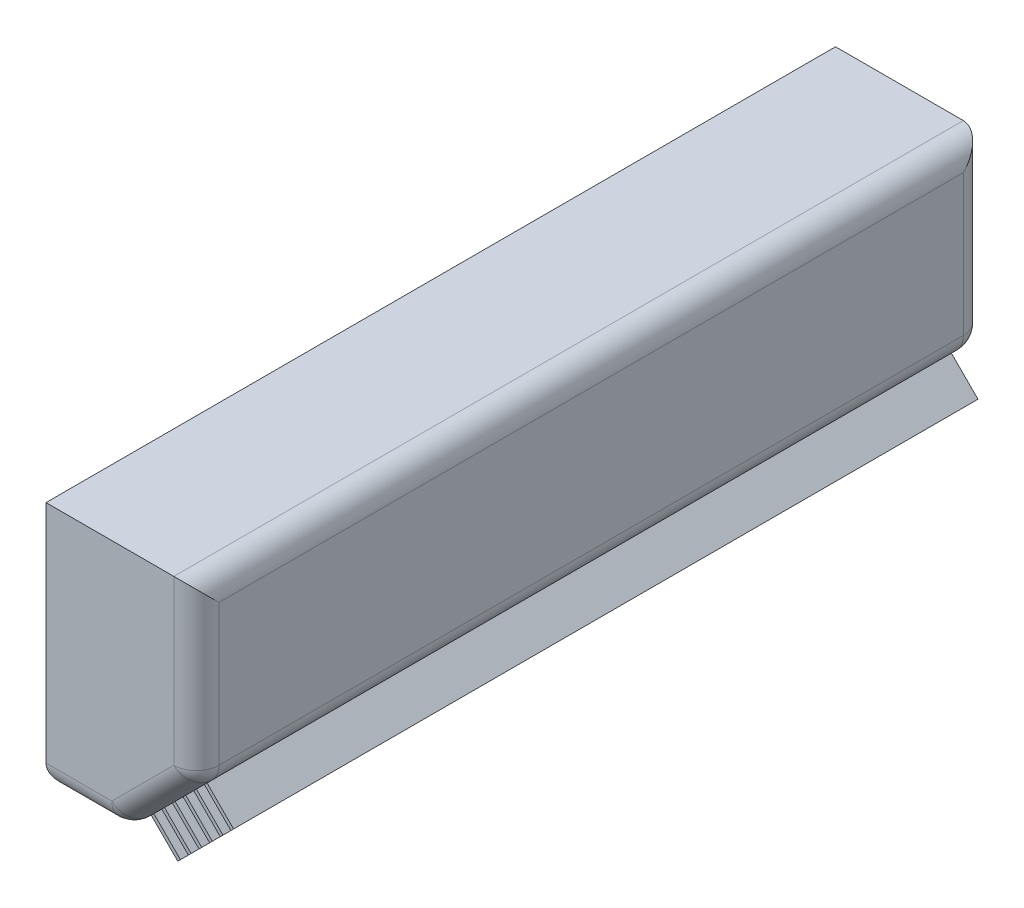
ISO-10303-21;
HEADER;
FILE_DESCRIPTION(('STEP AP214'),'2;1');
FILE_NAME('part.step','',(''),(''),'','','');
FILE_SCHEMA(('AUTOMOTIVE_DESIGN { 1 0 10303 214 1 1 1 1 }'));
ENDSEC;
DATA;
#1=APPLICATION_CONTEXT('core data for automotive mechanical design processes');
#2=APPLICATION_PROTOCOL_DEFINITION('international standard','automotive_design',2000,#1);
#3=PRODUCT_CONTEXT('',#1,'mechanical');
#4=PRODUCT('Part','Part','',(#3));
#5=PRODUCT_RELATED_PRODUCT_CATEGORY('part','',(#4));
#6=PRODUCT_DEFINITION_FORMATION('','',#4);
#7=PRODUCT_DEFINITION_CONTEXT('part definition',#1,'design');
#8=PRODUCT_DEFINITION('design','',#6,#7);
#9=PRODUCT_DEFINITION_SHAPE('','',#8);
#10=(LENGTH_UNIT() NAMED_UNIT(*) SI_UNIT(.MILLI.,.METRE.));
#11=(NAMED_UNIT(*) PLANE_ANGLE_UNIT() SI_UNIT($,.RADIAN.));
#12=(NAMED_UNIT(*) SI_UNIT($,.STERADIAN.) SOLID_ANGLE_UNIT());
#13=UNCERTAINTY_MEASURE_WITH_UNIT(LENGTH_MEASURE(1.E-05),#10,'distance_accuracy_value','');
#14=(GEOMETRIC_REPRESENTATION_CONTEXT(3) GLOBAL_UNCERTAINTY_ASSIGNED_CONTEXT((#13)) GLOBAL_UNIT_ASSIGNED_CONTEXT((#10,
#11,#12)) REPRESENTATION_CONTEXT('',''));
#15=CARTESIAN_POINT('',(0.,0.,0.));
#16=DIRECTION('',(0.,0.,1.));
#17=DIRECTION('',(1.,0.,0.));
#18=AXIS2_PLACEMENT_3D('',#15,#16,#17);
#19=CARTESIAN_POINT('',(0.,-115.,1050.));
#20=DIRECTION('',(-0.707106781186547,0.707106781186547,0.));
#21=DIRECTION('',(-0.707106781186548,-0.707106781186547,0.));
#22=AXIS2_PLACEMENT_3D('',#19,#20,#21);
#23=PLANE('',#22);
#24=DIRECTION('',(0.,0.,1.));
#25=VECTOR('',#24,1.);
#26=CARTESIAN_POINT('',(-86.5685424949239,-201.568542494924,1020.));
#27=LINE('',#26,#25);
#28=CARTESIAN_POINT('',(-86.5685424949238,-201.568542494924,29.9999999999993));
#29=VERTEX_POINT('',#28);
#30=CARTESIAN_POINT('',(-86.5685424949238,-201.568542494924,1020.));
#31=VERTEX_POINT('',#30);
#32=EDGE_CURVE('E593',#29,#31,#27,.T.);
#33=ORIENTED_EDGE('',*,*,#32,.F.);
#34=DIRECTION('',(0.707106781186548,0.707106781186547,0.));
#35=VECTOR('',#34,1.);
#36=CARTESIAN_POINT('',(0.,-115.,30.));
#37=LINE('',#36,#35);
#38=CARTESIAN_POINT('',(-75.9619407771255,-190.961940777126,30.));
#39=VERTEX_POINT('',#38);
#40=EDGE_CURVE('E578',#29,#39,#37,.T.);
#41=ORIENTED_EDGE('',*,*,#40,.T.);
#42=DIRECTION('',(0.,0.,-1.));
#43=VECTOR('',#42,1.);
#44=CARTESIAN_POINT('',(-75.9619407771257,-190.961940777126,1020.));
#45=LINE('',#44,#43);
#46=CARTESIAN_POINT('',(-75.9619407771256,-190.961940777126,1020.));
#47=VERTEX_POINT('',#46);
#48=EDGE_CURVE('E631',#47,#39,#45,.T.);
#49=ORIENTED_EDGE('',*,*,#48,.F.);
#50=DIRECTION('',(0.707106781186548,0.707106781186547,0.));
#51=VECTOR('',#50,1.);
#52=CARTESIAN_POINT('',(-100.,-215.,1020.));
#53=LINE('',#52,#51);
#54=EDGE_CURVE('E594',#47,#31,#53,.F.);
#55=ORIENTED_EDGE('',*,*,#54,.T.);
#56=EDGE_LOOP('',(#33,#41,#49,#55));
#57=FACE_BOUND('',#56,.T.);
#58=ADVANCED_FACE('F350',(#57),#23,.F.);
#59=DIRECTION('',(0.,0.,-1.));
#60=VECTOR('',#59,1.);
#61=CARTESIAN_POINT('',(-90.1040764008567,-205.104076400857,1020.));
#62=LINE('',#61,#60);
#63=CARTESIAN_POINT('',(-90.1040764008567,-205.104076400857,1020.));
#64=VERTEX_POINT('',#63);
#65=CARTESIAN_POINT('',(-90.1040764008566,-205.104076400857,30.));
#66=VERTEX_POINT('',#65);
#67=EDGE_CURVE('E365',#64,#66,#62,.T.);
#68=ORIENTED_EDGE('',*,*,#67,.F.);
#69=CARTESIAN_POINT('',(-91.2132034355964,-206.213203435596,1020.));
#70=VERTEX_POINT('',#69);
#71=EDGE_CURVE('E880',#64,#70,#53,.F.);
#72=ORIENTED_EDGE('',*,*,#71,.T.);
#73=DIRECTION('',(0.,0.,-1.));
#74=VECTOR('',#73,1.);
#75=CARTESIAN_POINT('',(-91.2132034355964,-206.213203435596,1050.));
#76=LINE('',#75,#74);
#77=CARTESIAN_POINT('',(-91.2132034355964,-206.213203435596,30.));
#78=VERTEX_POINT('',#77);
#79=EDGE_CURVE('E11',#70,#78,#76,.T.);
#80=ORIENTED_EDGE('',*,*,#79,.T.);
#81=EDGE_CURVE('E589',#78,#66,#37,.T.);
#82=ORIENTED_EDGE('',*,*,#81,.T.);
#83=EDGE_LOOP('',(#68,#72,#80,#82));
#84=FACE_BOUND('',#83,.T.);
#85=ADVANCED_FACE('F970',(#84),#23,.F.);
#86=DIRECTION('',(0.,0.,1.));
#87=VECTOR('',#86,1.);
#88=CARTESIAN_POINT('',(-72.426406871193,-187.426406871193,1020.));
#89=LINE('',#88,#87);
#90=CARTESIAN_POINT('',(-72.4264068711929,-187.426406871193,29.9999999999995));
#91=VERTEX_POINT('',#90);
#92=CARTESIAN_POINT('',(-72.426406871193,-187.426406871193,1020.));
#93=VERTEX_POINT('',#92);
#94=EDGE_CURVE('E625',#91,#93,#89,.T.);
#95=ORIENTED_EDGE('',*,*,#94,.F.);
#96=CARTESIAN_POINT('',(-61.8198051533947,-176.819805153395,30.));
#97=VERTEX_POINT('',#96);
#98=EDGE_CURVE('E590',#91,#97,#37,.T.);
#99=ORIENTED_EDGE('',*,*,#98,.T.);
#100=DIRECTION('',(0.,0.,-1.));
#101=VECTOR('',#100,1.);
#102=CARTESIAN_POINT('',(-61.8198051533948,-176.819805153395,1020.));
#103=LINE('',#102,#101);
#104=CARTESIAN_POINT('',(-61.8198051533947,-176.819805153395,1020.));
#105=VERTEX_POINT('',#104);
#106=EDGE_CURVE('E661',#105,#97,#103,.T.);
#107=ORIENTED_EDGE('',*,*,#106,.F.);
#108=EDGE_CURVE('E889',#105,#93,#53,.F.);
#109=ORIENTED_EDGE('',*,*,#108,.T.);
#110=EDGE_LOOP('',(#95,#99,#107,#109));
#111=FACE_BOUND('',#110,.T.);
#112=ADVANCED_FACE('F943',(#111),#23,.F.);
#113=DIRECTION('',(0.,0.,1.));
#114=VECTOR('',#113,1.);
#115=CARTESIAN_POINT('',(-58.284271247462,-173.284271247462,1020.));
#116=LINE('',#115,#114);
#117=CARTESIAN_POINT('',(-58.2842712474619,-173.284271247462,29.9999999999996));
#118=VERTEX_POINT('',#117);
#119=CARTESIAN_POINT('',(-58.284271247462,-173.284271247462,1020.));
#120=VERTEX_POINT('',#119);
#121=EDGE_CURVE('E655',#118,#120,#116,.T.);
#122=ORIENTED_EDGE('',*,*,#121,.F.);
#123=CARTESIAN_POINT('',(-47.6776695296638,-162.677669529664,30.));
#124=VERTEX_POINT('',#123);
#125=EDGE_CURVE('E918',#118,#124,#37,.T.);
#126=ORIENTED_EDGE('',*,*,#125,.T.);
#127=DIRECTION('',(0.,0.,-1.));
#128=VECTOR('',#127,1.);
#129=CARTESIAN_POINT('',(-47.6776695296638,-162.677669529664,1020.));
#130=LINE('',#129,#128);
#131=CARTESIAN_POINT('',(-47.6776695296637,-162.677669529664,1020.));
#132=VERTEX_POINT('',#131);
#133=EDGE_CURVE('E694',#132,#124,#130,.T.);
#134=ORIENTED_EDGE('',*,*,#133,.F.);
#135=EDGE_CURVE('E891',#132,#120,#53,.F.);
#136=ORIENTED_EDGE('',*,*,#135,.T.);
#137=EDGE_LOOP('',(#122,#126,#134,#136));
#138=FACE_BOUND('',#137,.T.);
#139=ADVANCED_FACE('F924',(#138),#23,.F.);
#140=DIRECTION('',(0.,0.,1.));
#141=VECTOR('',#140,1.);
#142=CARTESIAN_POINT('',(-44.1421356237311,-159.142135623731,1020.));
#143=LINE('',#142,#141);
#144=CARTESIAN_POINT('',(-44.142135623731,-159.142135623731,29.9999999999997));
#145=VERTEX_POINT('',#144);
#146=CARTESIAN_POINT('',(-44.1421356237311,-159.142135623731,1020.));
#147=VERTEX_POINT('',#146);
#148=EDGE_CURVE('E688',#145,#147,#143,.T.);
#149=ORIENTED_EDGE('',*,*,#148,.F.);
#150=CARTESIAN_POINT('',(-33.5355339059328,-148.535533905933,30.));
#151=VERTEX_POINT('',#150);
#152=EDGE_CURVE('E920',#145,#151,#37,.T.);
#153=ORIENTED_EDGE('',*,*,#152,.T.);
#154=DIRECTION('',(0.,0.,-1.));
#155=VECTOR('',#154,1.);
#156=CARTESIAN_POINT('',(-33.5355339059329,-148.535533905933,1020.));
#157=LINE('',#156,#155);
#158=CARTESIAN_POINT('',(-33.5355339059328,-148.535533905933,1020.));
#159=VERTEX_POINT('',#158);
#160=EDGE_CURVE('E727',#159,#151,#157,.T.);
#161=ORIENTED_EDGE('',*,*,#160,.F.);
#162=EDGE_CURVE('E887',#159,#147,#53,.F.);
#163=ORIENTED_EDGE('',*,*,#162,.T.);
#164=EDGE_LOOP('',(#149,#153,#161,#163));
#165=FACE_BOUND('',#164,.T.);
#166=ADVANCED_FACE('F903',(#165),#23,.F.);
#167=DIRECTION('',(0.,0.,1.));
#168=VECTOR('',#167,1.);
#169=CARTESIAN_POINT('',(-30.0000000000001,-145.,1020.));
#170=LINE('',#169,#168);
#171=CARTESIAN_POINT('',(-30.,-145.,29.9999999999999));
#172=VERTEX_POINT('',#171);
#173=CARTESIAN_POINT('',(-30.0000000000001,-145.,1020.));
#174=VERTEX_POINT('',#173);
#175=EDGE_CURVE('E721',#172,#174,#170,.T.);
#176=ORIENTED_EDGE('',*,*,#175,.F.);
#177=CARTESIAN_POINT('',(-19.3933982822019,-134.393398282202,30.));
#178=VERTEX_POINT('',#177);
#179=EDGE_CURVE('E1007',#172,#178,#37,.T.);
#180=ORIENTED_EDGE('',*,*,#179,.T.);
#181=DIRECTION('',(0.,0.,-1.));
#182=VECTOR('',#181,1.);
#183=CARTESIAN_POINT('',(-19.3933982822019,-134.393398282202,1020.));
#184=LINE('',#183,#182);
#185=CARTESIAN_POINT('',(-19.3933982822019,-134.393398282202,1020.));
#186=VERTEX_POINT('',#185);
#187=EDGE_CURVE('E760',#186,#178,#184,.T.);
#188=ORIENTED_EDGE('',*,*,#187,.F.);
#189=EDGE_CURVE('E882',#186,#174,#53,.F.);
#190=ORIENTED_EDGE('',*,*,#189,.T.);
#191=EDGE_LOOP('',(#176,#180,#188,#190));
#192=FACE_BOUND('',#191,.T.);
#193=ADVANCED_FACE('F979',(#192),#23,.F.);
#194=DIRECTION('',(0.,0.,1.));
#195=VECTOR('',#194,1.);
#196=CARTESIAN_POINT('',(-15.8578643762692,-130.857864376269,1020.));
#197=LINE('',#196,#195);
#198=CARTESIAN_POINT('',(-15.8578643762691,-130.857864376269,30.));
#199=VERTEX_POINT('',#198);
#200=CARTESIAN_POINT('',(-15.8578643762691,-130.857864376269,1020.));
#201=VERTEX_POINT('',#200);
#202=EDGE_CURVE('E754',#199,#201,#197,.T.);
#203=ORIENTED_EDGE('',*,*,#202,.F.);
#204=CARTESIAN_POINT('',(-8.7867965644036,-123.786796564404,30.));
#205=VERTEX_POINT('',#204);
#206=EDGE_CURVE('E877',#199,#205,#37,.T.);
#207=ORIENTED_EDGE('',*,*,#206,.T.);
#208=DIRECTION('',(0.,0.,-1.));
#209=VECTOR('',#208,1.);
#210=CARTESIAN_POINT('',(-8.7867965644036,-123.786796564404,1050.));
#211=LINE('',#210,#209);
#212=CARTESIAN_POINT('',(-8.7867965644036,-123.786796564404,1020.));
#213=VERTEX_POINT('',#212);
#214=EDGE_CURVE('E879',#205,#213,#211,.F.);
#215=ORIENTED_EDGE('',*,*,#214,.T.);
#216=EDGE_CURVE('E358',#213,#201,#53,.F.);
#217=ORIENTED_EDGE('',*,*,#216,.T.);
#218=EDGE_LOOP('',(#203,#207,#215,#217));
#219=FACE_BOUND('',#218,.T.);
#220=ADVANCED_FACE('F972',(#219),#23,.F.);
#221=CARTESIAN_POINT('',(-200.,115.,1050.));
#222=DIRECTION('',(1.,0.,0.));
#223=DIRECTION('',(0.,1.,0.));
#224=AXIS2_PLACEMENT_3D('',#221,#222,#223);
#225=PLANE('',#224);
#226=DIRECTION('',(0.,-1.,0.));
#227=VECTOR('',#226,1.);
#228=CARTESIAN_POINT('',(-200.,115.,0.));
#229=LINE('',#228,#227);
#230=CARTESIAN_POINT('',(-200.,115.,0.));
#231=VERTEX_POINT('',#230);
#232=CARTESIAN_POINT('',(-200.,-185.,0.));
#233=VERTEX_POINT('',#232);
#234=EDGE_CURVE('E830',#231,#233,#229,.T.);
#235=ORIENTED_EDGE('',*,*,#234,.T.);
#236=DIRECTION('',(0.,0.,-1.));
#237=VECTOR('',#236,1.);
#238=CARTESIAN_POINT('',(-200.,-185.,1050.));
#239=LINE('',#238,#237);
#240=CARTESIAN_POINT('',(-200.,-185.,1050.));
#241=VERTEX_POINT('',#240);
#242=EDGE_CURVE('E852',#233,#241,#239,.F.);
#243=ORIENTED_EDGE('',*,*,#242,.T.);
#244=DIRECTION('',(0.,-1.,0.));
#245=VECTOR('',#244,1.);
#246=CARTESIAN_POINT('',(-200.,115.,1050.));
#247=LINE('',#246,#245);
#248=CARTESIAN_POINT('',(-200.,115.,1050.));
#249=VERTEX_POINT('',#248);
#250=EDGE_CURVE('E835',#249,#241,#247,.T.);
#251=ORIENTED_EDGE('',*,*,#250,.F.);
#252=DIRECTION('',(0.,0.,-1.));
#253=VECTOR('',#252,1.);
#254=CARTESIAN_POINT('',(-200.,115.,1050.));
#255=LINE('',#254,#253);
#256=EDGE_CURVE('E840',#249,#231,#255,.T.);
#257=ORIENTED_EDGE('',*,*,#256,.T.);
#258=EDGE_LOOP('',(#235,#243,#251,#257));
#259=FACE_BOUND('',#258,.T.);
#260=ADVANCED_FACE('F352',(#259),#225,.F.);
#261=CARTESIAN_POINT('',(-200.,-215.,1050.));
#262=DIRECTION('',(0.,1.,0.));
#263=DIRECTION('',(-1.,0.,0.));
#264=AXIS2_PLACEMENT_3D('',#261,#262,#263);
#265=PLANE('',#264);
#266=DIRECTION('',(1.,0.,0.));
#267=VECTOR('',#266,1.);
#268=CARTESIAN_POINT('',(-200.,-215.,1020.));
#269=LINE('',#268,#267);
#270=CARTESIAN_POINT('',(-112.426406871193,-215.,1020.));
#271=VERTEX_POINT('',#270);
#272=CARTESIAN_POINT('',(-170.,-215.,1020.));
#273=VERTEX_POINT('',#272);
#274=EDGE_CURVE('E847',#271,#273,#269,.F.);
#275=ORIENTED_EDGE('',*,*,#274,.T.);
#276=DIRECTION('',(0.,0.,-1.));
#277=VECTOR('',#276,1.);
#278=CARTESIAN_POINT('',(-170.,-215.,1050.));
#279=LINE('',#278,#277);
#280=CARTESIAN_POINT('',(-170.,-215.,30.));
#281=VERTEX_POINT('',#280);
#282=EDGE_CURVE('E849',#273,#281,#279,.T.);
#283=ORIENTED_EDGE('',*,*,#282,.T.);
#284=DIRECTION('',(1.,0.,0.));
#285=VECTOR('',#284,1.);
#286=CARTESIAN_POINT('',(-200.,-215.,30.));
#287=LINE('',#286,#285);
#288=CARTESIAN_POINT('',(-112.426406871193,-215.,30.));
#289=VERTEX_POINT('',#288);
#290=EDGE_CURVE('E845',#281,#289,#287,.T.);
#291=ORIENTED_EDGE('',*,*,#290,.T.);
#292=DIRECTION('',(0.,0.,-1.));
#293=VECTOR('',#292,1.);
#294=CARTESIAN_POINT('',(-112.426406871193,-215.,1050.));
#295=LINE('',#294,#293);
#296=EDGE_CURVE('E843',#289,#271,#295,.F.);
#297=ORIENTED_EDGE('',*,*,#296,.T.);
#298=EDGE_LOOP('',(#275,#283,#291,#297));
#299=FACE_BOUND('',#298,.T.);
#300=ADVANCED_FACE('F985',(#299),#265,.F.);
#301=CARTESIAN_POINT('',(0.,115.,1050.));
#302=DIRECTION('',(-1.,0.,0.));
#303=DIRECTION('',(0.,-1.,0.));
#304=AXIS2_PLACEMENT_3D('',#301,#302,#303);
#305=PLANE('',#304);
#306=DIRECTION('',(0.,0.,-1.));
#307=VECTOR('',#306,1.);
#308=CARTESIAN_POINT('',(0.,85.,1050.));
#309=LINE('',#308,#307);
#310=CARTESIAN_POINT('',(0.,85.,30.));
#311=VERTEX_POINT('',#310);
#312=CARTESIAN_POINT('',(0.,85.,1020.));
#313=VERTEX_POINT('',#312);
#314=EDGE_CURVE('E871',#311,#313,#309,.F.);
#315=ORIENTED_EDGE('',*,*,#314,.T.);
#316=DIRECTION('',(0.,1.,0.));
#317=VECTOR('',#316,1.);
#318=CARTESIAN_POINT('',(0.,-115.,1020.));
#319=LINE('',#318,#317);
#320=CARTESIAN_POINT('',(0.,-102.573593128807,1020.));
#321=VERTEX_POINT('',#320);
#322=EDGE_CURVE('E873',#313,#321,#319,.F.);
#323=ORIENTED_EDGE('',*,*,#322,.T.);
#324=DIRECTION('',(0.,0.,-1.));
#325=VECTOR('',#324,1.);
#326=CARTESIAN_POINT('',(0.,-102.573593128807,1050.));
#327=LINE('',#326,#325);
#328=CARTESIAN_POINT('',(0.,-102.573593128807,30.));
#329=VERTEX_POINT('',#328);
#330=EDGE_CURVE('E867',#321,#329,#327,.T.);
#331=ORIENTED_EDGE('',*,*,#330,.T.);
#332=DIRECTION('',(0.,1.,0.));
#333=VECTOR('',#332,1.);
#334=CARTESIAN_POINT('',(0.,115.,30.));
#335=LINE('',#334,#333);
#336=EDGE_CURVE('E869',#329,#311,#335,.T.);
#337=ORIENTED_EDGE('',*,*,#336,.T.);
#338=EDGE_LOOP('',(#315,#323,#331,#337));
#339=FACE_BOUND('',#338,.T.);
#340=ADVANCED_FACE('F1080',(#339),#305,.F.);
#341=CARTESIAN_POINT('',(-200.,115.,1050.));
#342=DIRECTION('',(0.,-1.,0.));
#343=DIRECTION('',(1.,0.,0.));
#344=AXIS2_PLACEMENT_3D('',#341,#342,#343);
#345=PLANE('',#344);
#346=DIRECTION('',(-1.,0.,0.));
#347=VECTOR('',#346,1.);
#348=CARTESIAN_POINT('',(-200.,115.,1050.));
#349=LINE('',#348,#347);
#350=CARTESIAN_POINT('',(-30.,115.,1050.));
#351=VERTEX_POINT('',#350);
#352=EDGE_CURVE('E838',#351,#249,#349,.T.);
#353=ORIENTED_EDGE('',*,*,#352,.F.);
#354=DIRECTION('',(0.,0.,-1.));
#355=VECTOR('',#354,1.);
#356=CARTESIAN_POINT('',(-30.,115.,1050.));
#357=LINE('',#356,#355);
#358=CARTESIAN_POINT('',(-30.,115.,0.));
#359=VERTEX_POINT('',#358);
#360=EDGE_CURVE('E876',#351,#359,#357,.T.);
#361=ORIENTED_EDGE('',*,*,#360,.T.);
#362=DIRECTION('',(-1.,0.,0.));
#363=VECTOR('',#362,1.);
#364=CARTESIAN_POINT('',(-200.,115.,0.));
#365=LINE('',#364,#363);
#366=EDGE_CURVE('E833',#359,#231,#365,.T.);
#367=ORIENTED_EDGE('',*,*,#366,.T.);
#368=ORIENTED_EDGE('',*,*,#256,.F.);
#369=EDGE_LOOP('',(#353,#361,#367,#368));
#370=FACE_BOUND('',#369,.T.);
#371=ADVANCED_FACE('F1077',(#370),#345,.F.);
#372=CARTESIAN_POINT('',(-200.,-215.,1050.));
#373=DIRECTION('',(0.,0.,1.));
#374=DIRECTION('',(1.,0.,0.));
#375=AXIS2_PLACEMENT_3D('',#372,#373,#374);
#376=PLANE('',#375);
#377=ORIENTED_EDGE('',*,*,#250,.T.);
#378=DIRECTION('',(1.,0.,0.));
#379=VECTOR('',#378,1.);
#380=CARTESIAN_POINT('',(-100.,-185.,1050.));
#381=LINE('',#380,#379);
#382=CARTESIAN_POINT('',(-112.426406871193,-185.,1050.));
#383=VERTEX_POINT('',#382);
#384=EDGE_CURVE('E859',#241,#383,#381,.T.);
#385=ORIENTED_EDGE('',*,*,#384,.T.);
#386=DIRECTION('',(0.707106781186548,0.707106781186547,0.));
#387=VECTOR('',#386,1.);
#388=CARTESIAN_POINT('',(-21.2132034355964,-93.7867965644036,1050.));
#389=LINE('',#388,#387);
#390=CARTESIAN_POINT('',(-30.,-102.573593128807,1050.));
#391=VERTEX_POINT('',#390);
#392=EDGE_CURVE('E855',#383,#391,#389,.T.);
#393=ORIENTED_EDGE('',*,*,#392,.T.);
#394=DIRECTION('',(0.,1.,0.));
#395=VECTOR('',#394,1.);
#396=CARTESIAN_POINT('',(-30.,115.,1050.));
#397=LINE('',#396,#395);
#398=EDGE_CURVE('E857',#391,#351,#397,.T.);
#399=ORIENTED_EDGE('',*,*,#398,.T.);
#400=ORIENTED_EDGE('',*,*,#352,.T.);
#401=EDGE_LOOP('',(#377,#385,#393,#399,#400));
#402=FACE_BOUND('',#401,.T.);
#403=ADVANCED_FACE('F1073',(#402),#376,.T.);
#404=CARTESIAN_POINT('',(-200.,-215.,0.));
#405=DIRECTION('',(0.,0.,1.));
#406=DIRECTION('',(1.,0.,0.));
#407=AXIS2_PLACEMENT_3D('',#404,#405,#406);
#408=PLANE('',#407);
#409=DIRECTION('',(0.707106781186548,0.707106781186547,0.));
#410=VECTOR('',#409,1.);
#411=CARTESIAN_POINT('',(-171.213203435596,-243.786796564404,0.));
#412=LINE('',#411,#410);
#413=CARTESIAN_POINT('',(-30.,-102.573593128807,0.));
#414=VERTEX_POINT('',#413);
#415=CARTESIAN_POINT('',(-112.426406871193,-185.,0.));
#416=VERTEX_POINT('',#415);
#417=EDGE_CURVE('E861',#414,#416,#412,.F.);
#418=ORIENTED_EDGE('',*,*,#417,.T.);
#419=DIRECTION('',(1.,0.,0.));
#420=VECTOR('',#419,1.);
#421=CARTESIAN_POINT('',(-200.,-185.,0.));
#422=LINE('',#421,#420);
#423=EDGE_CURVE('E865',#416,#233,#422,.F.);
#424=ORIENTED_EDGE('',*,*,#423,.T.);
#425=ORIENTED_EDGE('',*,*,#234,.F.);
#426=ORIENTED_EDGE('',*,*,#366,.F.);
#427=DIRECTION('',(0.,1.,0.));
#428=VECTOR('',#427,1.);
#429=CARTESIAN_POINT('',(-30.,-215.,0.));
#430=LINE('',#429,#428);
#431=EDGE_CURVE('E863',#359,#414,#430,.F.);
#432=ORIENTED_EDGE('',*,*,#431,.T.);
#433=EDGE_LOOP('',(#418,#424,#425,#426,#432));
#434=FACE_BOUND('',#433,.T.);
#435=ADVANCED_FACE('F1069',(#434),#408,.F.);
#436=CARTESIAN_POINT('',(-30.,85.,1050.));
#437=DIRECTION('',(0.,0.,-1.));
#438=DIRECTION('',(-1.,0.,0.));
#439=AXIS2_PLACEMENT_3D('',#436,#437,#438);
#440=CYLINDRICAL_SURFACE('',#439,30.);
#441=CARTESIAN_POINT('',(-30.,85.,30.));
#442=DIRECTION('',(0.,0.707106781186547,0.707106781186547));
#443=DIRECTION('',(0.,0.707106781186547,-0.707106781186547));
#444=AXIS2_PLACEMENT_3D('',#441,#442,#443);
#445=ELLIPSE('',#444,42.4264068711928,30.);
#446=EDGE_CURVE('E824',#359,#311,#445,.F.);
#447=ORIENTED_EDGE('',*,*,#446,.F.);
#448=ORIENTED_EDGE('',*,*,#360,.F.);
#449=CARTESIAN_POINT('',(-30.,85.,1020.));
#450=DIRECTION('',(0.,0.707106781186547,-0.707106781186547));
#451=DIRECTION('',(0.,-0.707106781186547,-0.707106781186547));
#452=AXIS2_PLACEMENT_3D('',#449,#450,#451);
#453=ELLIPSE('',#452,42.4264068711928,30.);
#454=EDGE_CURVE('E827',#313,#351,#453,.F.);
#455=ORIENTED_EDGE('',*,*,#454,.F.);
#456=ORIENTED_EDGE('',*,*,#314,.F.);
#457=EDGE_LOOP('',(#447,#448,#455,#456));
#458=FACE_BOUND('',#457,.T.);
#459=ADVANCED_FACE('F1065',(#458),#440,.T.);
#460=CARTESIAN_POINT('',(-30.,-215.,1020.));
#461=DIRECTION('',(0.,-1.,0.));
#462=DIRECTION('',(1.,0.,0.));
#463=AXIS2_PLACEMENT_3D('',#460,#461,#462);
#464=CYLINDRICAL_SURFACE('',#463,30.);
#465=ORIENTED_EDGE('',*,*,#454,.T.);
#466=ORIENTED_EDGE('',*,*,#398,.F.);
#467=CARTESIAN_POINT('',(-30.,-102.573593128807,1020.));
#468=DIRECTION('',(0.,-1.,0.));
#469=DIRECTION('',(0.,0.,-1.));
#470=AXIS2_PLACEMENT_3D('',#467,#468,#469);
#471=CIRCLE('',#470,30.);
#472=EDGE_CURVE('E821',#321,#391,#471,.T.);
#473=ORIENTED_EDGE('',*,*,#472,.F.);
#474=ORIENTED_EDGE('',*,*,#322,.F.);
#475=EDGE_LOOP('',(#465,#466,#473,#474));
#476=FACE_BOUND('',#475,.T.);
#477=ADVANCED_FACE('F1061',(#476),#464,.T.);
#478=CARTESIAN_POINT('',(-30.,-102.573593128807,1050.));
#479=DIRECTION('',(0.,0.,-1.));
#480=DIRECTION('',(-1.,0.,0.));
#481=AXIS2_PLACEMENT_3D('',#478,#479,#480);
#482=CYLINDRICAL_SURFACE('',#481,30.);
#483=CARTESIAN_POINT('',(-30.,-102.573593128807,30.));
#484=DIRECTION('',(0.,0.,-1.));
#485=DIRECTION('',(-1.,0.,0.));
#486=AXIS2_PLACEMENT_3D('',#483,#484,#485);
#487=CIRCLE('',#486,30.);
#488=EDGE_CURVE('E816',#329,#205,#487,.T.);
#489=ORIENTED_EDGE('',*,*,#488,.F.);
#490=ORIENTED_EDGE('',*,*,#330,.F.);
#491=CARTESIAN_POINT('',(-30.,-102.573593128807,1020.));
#492=DIRECTION('',(0.,0.,1.));
#493=DIRECTION('',(1.,0.,0.));
#494=AXIS2_PLACEMENT_3D('',#491,#492,#493);
#495=CIRCLE('',#494,30.);
#496=EDGE_CURVE('E819',#213,#321,#495,.T.);
#497=ORIENTED_EDGE('',*,*,#496,.F.);
#498=ORIENTED_EDGE('',*,*,#214,.F.);
#499=EDGE_LOOP('',(#489,#490,#497,#498));
#500=FACE_BOUND('',#499,.T.);
#501=ADVANCED_FACE('F1057',(#500),#482,.T.);
#502=CARTESIAN_POINT('',(-30.,115.,30.));
#503=DIRECTION('',(0.,1.,0.));
#504=DIRECTION('',(-1.,0.,0.));
#505=AXIS2_PLACEMENT_3D('',#502,#503,#504);
#506=CYLINDRICAL_SURFACE('',#505,30.);
#507=ORIENTED_EDGE('',*,*,#446,.T.);
#508=ORIENTED_EDGE('',*,*,#336,.F.);
#509=CARTESIAN_POINT('',(-30.,-102.573593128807,30.));
#510=DIRECTION('',(0.,-1.,0.));
#511=DIRECTION('',(0.,0.,-1.));
#512=AXIS2_PLACEMENT_3D('',#509,#510,#511);
#513=CIRCLE('',#512,30.);
#514=EDGE_CURVE('E813',#414,#329,#513,.T.);
#515=ORIENTED_EDGE('',*,*,#514,.F.);
#516=ORIENTED_EDGE('',*,*,#431,.F.);
#517=EDGE_LOOP('',(#507,#508,#515,#516));
#518=FACE_BOUND('',#517,.T.);
#519=ADVANCED_FACE('F1053',(#518),#506,.T.);
#520=CARTESIAN_POINT('',(-30.,-102.573593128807,1020.));
#521=DIRECTION('',(0.,0.,1.));
#522=DIRECTION('',(1.,0.,0.));
#523=AXIS2_PLACEMENT_3D('',#520,#521,#522);
#524=SPHERICAL_SURFACE('',#523,30.);
#525=ORIENTED_EDGE('',*,*,#496,.T.);
#526=ORIENTED_EDGE('',*,*,#472,.T.);
#527=CARTESIAN_POINT('',(-30.,-102.573593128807,1020.));
#528=DIRECTION('',(0.707106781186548,0.707106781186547,0.));
#529=DIRECTION('',(-0.707106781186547,0.707106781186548,0.));
#530=AXIS2_PLACEMENT_3D('',#527,#528,#529);
#531=CIRCLE('',#530,30.);
#532=EDGE_CURVE('E810',#213,#391,#531,.F.);
#533=ORIENTED_EDGE('',*,*,#532,.F.);
#534=EDGE_LOOP('',(#525,#526,#533));
#535=FACE_BOUND('',#534,.T.);
#536=ADVANCED_FACE('F1049',(#535),#524,.T.);
#537=CARTESIAN_POINT('',(-30.,-102.573593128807,30.));
#538=DIRECTION('',(0.,0.,1.));
#539=DIRECTION('',(1.,0.,0.));
#540=AXIS2_PLACEMENT_3D('',#537,#538,#539);
#541=SPHERICAL_SURFACE('',#540,30.);
#542=ORIENTED_EDGE('',*,*,#514,.T.);
#543=ORIENTED_EDGE('',*,*,#488,.T.);
#544=CARTESIAN_POINT('',(-30.,-102.573593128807,30.));
#545=DIRECTION('',(0.707106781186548,0.707106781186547,0.));
#546=DIRECTION('',(-0.707106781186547,0.707106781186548,0.));
#547=AXIS2_PLACEMENT_3D('',#544,#545,#546);
#548=CIRCLE('',#547,30.);
#549=EDGE_CURVE('E808',#414,#205,#548,.F.);
#550=ORIENTED_EDGE('',*,*,#549,.F.);
#551=EDGE_LOOP('',(#542,#543,#550));
#552=FACE_BOUND('',#551,.T.);
#553=ADVANCED_FACE('F1046',(#552),#541,.T.);
#554=CARTESIAN_POINT('',(-171.213203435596,-243.786796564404,1020.));
#555=DIRECTION('',(-0.707106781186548,-0.707106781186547,0.));
#556=DIRECTION('',(0.707106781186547,-0.707106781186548,0.));
#557=AXIS2_PLACEMENT_3D('',#554,#555,#556);
#558=CYLINDRICAL_SURFACE('',#557,30.);
#559=ORIENTED_EDGE('',*,*,#532,.T.);
#560=ORIENTED_EDGE('',*,*,#392,.F.);
#561=CARTESIAN_POINT('',(-112.426406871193,-185.,1020.));
#562=DIRECTION('',(-0.707106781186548,-0.707106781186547,0.));
#563=DIRECTION('',(0.707106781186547,-0.707106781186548,0.));
#564=AXIS2_PLACEMENT_3D('',#561,#562,#563);
#565=CIRCLE('',#564,30.);
#566=EDGE_CURVE('E805',#70,#383,#565,.T.);
#567=ORIENTED_EDGE('',*,*,#566,.F.);
#568=ORIENTED_EDGE('',*,*,#71,.F.);
#569=DIRECTION('',(-0.707106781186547,-0.707106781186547,0.));
#570=VECTOR('',#569,1.);
#571=CARTESIAN_POINT('',(-86.5685424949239,-201.568542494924,1020.));
#572=LINE('',#571,#570);
#573=EDGE_CURVE('E372',#31,#64,#572,.T.);
#574=ORIENTED_EDGE('',*,*,#573,.F.);
#575=ORIENTED_EDGE('',*,*,#54,.F.);
#576=DIRECTION('',(-0.707106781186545,-0.70710678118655,0.));
#577=VECTOR('',#576,1.);
#578=CARTESIAN_POINT('',(-72.426406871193,-187.426406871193,1020.));
#579=LINE('',#578,#577);
#580=EDGE_CURVE('E628',#93,#47,#579,.T.);
#581=ORIENTED_EDGE('',*,*,#580,.F.);
#582=ORIENTED_EDGE('',*,*,#108,.F.);
#583=DIRECTION('',(-0.707106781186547,-0.707106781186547,0.));
#584=VECTOR('',#583,1.);
#585=CARTESIAN_POINT('',(-58.284271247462,-173.284271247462,1020.));
#586=LINE('',#585,#584);
#587=EDGE_CURVE('E658',#120,#105,#586,.T.);
#588=ORIENTED_EDGE('',*,*,#587,.F.);
#589=ORIENTED_EDGE('',*,*,#135,.F.);
#590=DIRECTION('',(-0.707106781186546,-0.707106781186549,0.));
#591=VECTOR('',#590,1.);
#592=CARTESIAN_POINT('',(-44.1421356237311,-159.142135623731,1020.));
#593=LINE('',#592,#591);
#594=EDGE_CURVE('E691',#147,#132,#593,.T.);
#595=ORIENTED_EDGE('',*,*,#594,.F.);
#596=ORIENTED_EDGE('',*,*,#162,.F.);
#597=DIRECTION('',(-0.707106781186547,-0.707106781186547,0.));
#598=VECTOR('',#597,1.);
#599=CARTESIAN_POINT('',(-30.0000000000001,-145.,1020.));
#600=LINE('',#599,#598);
#601=EDGE_CURVE('E724',#174,#159,#600,.T.);
#602=ORIENTED_EDGE('',*,*,#601,.F.);
#603=ORIENTED_EDGE('',*,*,#189,.F.);
#604=DIRECTION('',(-0.707106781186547,-0.707106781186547,0.));
#605=VECTOR('',#604,1.);
#606=CARTESIAN_POINT('',(-15.8578643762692,-130.857864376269,1020.));
#607=LINE('',#606,#605);
#608=EDGE_CURVE('E757',#201,#186,#607,.T.);
#609=ORIENTED_EDGE('',*,*,#608,.F.);
#610=ORIENTED_EDGE('',*,*,#216,.F.);
#611=EDGE_LOOP('',(#559,#560,#567,#568,#574,#575,#581,#582,#588,#589,#595,#596,#602,#603,#609,#610));
#612=FACE_BOUND('',#611,.T.);
#613=ADVANCED_FACE('F925',(#612),#558,.T.);
#614=CARTESIAN_POINT('',(-112.426406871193,-185.,1050.));
#615=DIRECTION('',(0.,0.,-1.));
#616=DIRECTION('',(-1.,0.,0.));
#617=AXIS2_PLACEMENT_3D('',#614,#615,#616);
#618=CYLINDRICAL_SURFACE('',#617,30.);
#619=CARTESIAN_POINT('',(-112.426406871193,-185.,30.));
#620=DIRECTION('',(0.,0.,-1.));
#621=DIRECTION('',(-1.,0.,0.));
#622=AXIS2_PLACEMENT_3D('',#619,#620,#621);
#623=CIRCLE('',#622,30.);
#624=EDGE_CURVE('E799',#78,#289,#623,.T.);
#625=ORIENTED_EDGE('',*,*,#624,.F.);
#626=ORIENTED_EDGE('',*,*,#79,.F.);
#627=CARTESIAN_POINT('',(-112.426406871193,-185.,1020.));
#628=DIRECTION('',(0.,0.,1.));
#629=DIRECTION('',(1.,0.,0.));
#630=AXIS2_PLACEMENT_3D('',#627,#628,#629);
#631=CIRCLE('',#630,30.);
#632=EDGE_CURVE('E802',#271,#70,#631,.T.);
#633=ORIENTED_EDGE('',*,*,#632,.F.);
#634=ORIENTED_EDGE('',*,*,#296,.F.);
#635=EDGE_LOOP('',(#625,#626,#633,#634));
#636=FACE_BOUND('',#635,.T.);
#637=ADVANCED_FACE('F1041',(#636),#618,.T.);
#638=CARTESIAN_POINT('',(-21.2132034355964,-93.7867965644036,30.));
#639=DIRECTION('',(0.707106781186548,0.707106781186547,0.));
#640=DIRECTION('',(-0.707106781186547,0.707106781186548,0.));
#641=AXIS2_PLACEMENT_3D('',#638,#639,#640);
#642=CYLINDRICAL_SURFACE('',#641,30.);
#643=ORIENTED_EDGE('',*,*,#549,.T.);
#644=ORIENTED_EDGE('',*,*,#206,.F.);
#645=DIRECTION('',(0.707106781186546,0.707106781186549,0.));
#646=VECTOR('',#645,1.);
#647=CARTESIAN_POINT('',(-15.8578643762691,-130.857864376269,30.));
#648=LINE('',#647,#646);
#649=EDGE_CURVE('E763',#178,#199,#648,.T.);
#650=ORIENTED_EDGE('',*,*,#649,.F.);
#651=ORIENTED_EDGE('',*,*,#179,.F.);
#652=DIRECTION('',(0.707106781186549,0.707106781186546,0.));
#653=VECTOR('',#652,1.);
#654=CARTESIAN_POINT('',(-30.,-145.,29.9999999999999));
#655=LINE('',#654,#653);
#656=EDGE_CURVE('E730',#151,#172,#655,.T.);
#657=ORIENTED_EDGE('',*,*,#656,.F.);
#658=ORIENTED_EDGE('',*,*,#152,.F.);
#659=DIRECTION('',(0.707106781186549,0.707106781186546,0.));
#660=VECTOR('',#659,1.);
#661=CARTESIAN_POINT('',(-44.142135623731,-159.142135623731,29.9999999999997));
#662=LINE('',#661,#660);
#663=EDGE_CURVE('E697',#124,#145,#662,.T.);
#664=ORIENTED_EDGE('',*,*,#663,.F.);
#665=ORIENTED_EDGE('',*,*,#125,.F.);
#666=DIRECTION('',(0.707106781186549,0.707106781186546,0.));
#667=VECTOR('',#666,1.);
#668=CARTESIAN_POINT('',(-58.2842712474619,-173.284271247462,29.9999999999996));
#669=LINE('',#668,#667);
#670=EDGE_CURVE('E664',#97,#118,#669,.T.);
#671=ORIENTED_EDGE('',*,*,#670,.F.);
#672=ORIENTED_EDGE('',*,*,#98,.F.);
#673=DIRECTION('',(0.707106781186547,0.707106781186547,0.));
#674=VECTOR('',#673,1.);
#675=CARTESIAN_POINT('',(-72.4264068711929,-187.426406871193,29.9999999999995));
#676=LINE('',#675,#674);
#677=EDGE_CURVE('E586',#39,#91,#676,.T.);
#678=ORIENTED_EDGE('',*,*,#677,.F.);
#679=ORIENTED_EDGE('',*,*,#40,.F.);
#680=DIRECTION('',(0.707106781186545,0.70710678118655,0.));
#681=VECTOR('',#680,1.);
#682=CARTESIAN_POINT('',(-86.5685424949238,-201.568542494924,29.9999999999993));
#683=LINE('',#682,#681);
#684=EDGE_CURVE('E584',#66,#29,#683,.T.);
#685=ORIENTED_EDGE('',*,*,#684,.F.);
#686=ORIENTED_EDGE('',*,*,#81,.F.);
#687=CARTESIAN_POINT('',(-112.426406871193,-185.,30.));
#688=DIRECTION('',(-0.707106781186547,-0.707106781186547,0.));
#689=DIRECTION('',(0.707106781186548,-0.707106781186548,0.));
#690=AXIS2_PLACEMENT_3D('',#687,#688,#689);
#691=CIRCLE('',#690,30.);
#692=EDGE_CURVE('E797',#416,#78,#691,.T.);
#693=ORIENTED_EDGE('',*,*,#692,.F.);
#694=ORIENTED_EDGE('',*,*,#417,.F.);
#695=EDGE_LOOP('',(#643,#644,#650,#651,#657,#658,#664,#665,#671,#672,#678,#679,#685,#686,#693,#694));
#696=FACE_BOUND('',#695,.T.);
#697=ADVANCED_FACE('F581',(#696),#642,.T.);
#698=CARTESIAN_POINT('',(-112.426406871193,-185.,1020.));
#699=DIRECTION('',(0.,0.,1.));
#700=DIRECTION('',(1.,0.,0.));
#701=AXIS2_PLACEMENT_3D('',#698,#699,#700);
#702=SPHERICAL_SURFACE('',#701,30.);
#703=ORIENTED_EDGE('',*,*,#632,.T.);
#704=ORIENTED_EDGE('',*,*,#566,.T.);
#705=CARTESIAN_POINT('',(-112.426406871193,-185.,1020.));
#706=DIRECTION('',(1.,0.,0.));
#707=DIRECTION('',(0.,1.,0.));
#708=AXIS2_PLACEMENT_3D('',#705,#706,#707);
#709=CIRCLE('',#708,30.);
#710=EDGE_CURVE('E794',#271,#383,#709,.F.);
#711=ORIENTED_EDGE('',*,*,#710,.F.);
#712=EDGE_LOOP('',(#703,#704,#711));
#713=FACE_BOUND('',#712,.T.);
#714=ADVANCED_FACE('F1034',(#713),#702,.T.);
#715=CARTESIAN_POINT('',(-112.426406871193,-185.,30.));
#716=DIRECTION('',(0.,0.,1.));
#717=DIRECTION('',(1.,0.,0.));
#718=AXIS2_PLACEMENT_3D('',#715,#716,#717);
#719=SPHERICAL_SURFACE('',#718,30.);
#720=ORIENTED_EDGE('',*,*,#692,.T.);
#721=ORIENTED_EDGE('',*,*,#624,.T.);
#722=CARTESIAN_POINT('',(-112.426406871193,-185.,30.));
#723=DIRECTION('',(1.,0.,0.));
#724=DIRECTION('',(0.,1.,0.));
#725=AXIS2_PLACEMENT_3D('',#722,#723,#724);
#726=CIRCLE('',#725,30.);
#727=EDGE_CURVE('E791',#416,#289,#726,.F.);
#728=ORIENTED_EDGE('',*,*,#727,.F.);
#729=EDGE_LOOP('',(#720,#721,#728));
#730=FACE_BOUND('',#729,.T.);
#731=ADVANCED_FACE('F1030',(#730),#719,.T.);
#732=CARTESIAN_POINT('',(-200.,-185.,1020.));
#733=DIRECTION('',(-1.,0.,0.));
#734=DIRECTION('',(0.,-1.,0.));
#735=AXIS2_PLACEMENT_3D('',#732,#733,#734);
#736=CYLINDRICAL_SURFACE('',#735,30.);
#737=ORIENTED_EDGE('',*,*,#710,.T.);
#738=ORIENTED_EDGE('',*,*,#384,.F.);
#739=CARTESIAN_POINT('',(-170.,-185.,1020.));
#740=DIRECTION('',(-0.707106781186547,0.,-0.707106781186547));
#741=DIRECTION('',(-0.707106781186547,0.,0.707106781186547));
#742=AXIS2_PLACEMENT_3D('',#739,#740,#741);
#743=ELLIPSE('',#742,42.4264068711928,30.);
#744=EDGE_CURVE('E789',#273,#241,#743,.T.);
#745=ORIENTED_EDGE('',*,*,#744,.F.);
#746=ORIENTED_EDGE('',*,*,#274,.F.);
#747=EDGE_LOOP('',(#737,#738,#745,#746));
#748=FACE_BOUND('',#747,.T.);
#749=ADVANCED_FACE('F1026',(#748),#736,.T.);
#750=CARTESIAN_POINT('',(-200.,-185.,30.));
#751=DIRECTION('',(1.,0.,0.));
#752=DIRECTION('',(0.,1.,0.));
#753=AXIS2_PLACEMENT_3D('',#750,#751,#752);
#754=CYLINDRICAL_SURFACE('',#753,30.);
#755=ORIENTED_EDGE('',*,*,#727,.T.);
#756=ORIENTED_EDGE('',*,*,#290,.F.);
#757=CARTESIAN_POINT('',(-170.,-185.,30.));
#758=DIRECTION('',(0.707106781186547,0.,-0.707106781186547));
#759=DIRECTION('',(0.707106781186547,0.,0.707106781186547));
#760=AXIS2_PLACEMENT_3D('',#757,#758,#759);
#761=ELLIPSE('',#760,42.4264068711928,30.);
#762=EDGE_CURVE('E787',#233,#281,#761,.F.);
#763=ORIENTED_EDGE('',*,*,#762,.F.);
#764=ORIENTED_EDGE('',*,*,#423,.F.);
#765=EDGE_LOOP('',(#755,#756,#763,#764));
#766=FACE_BOUND('',#765,.T.);
#767=ADVANCED_FACE('F1022',(#766),#754,.T.);
#768=CARTESIAN_POINT('',(-170.,-185.,1050.));
#769=DIRECTION('',(0.,0.,-1.));
#770=DIRECTION('',(-1.,0.,0.));
#771=AXIS2_PLACEMENT_3D('',#768,#769,#770);
#772=CYLINDRICAL_SURFACE('',#771,30.);
#773=ORIENTED_EDGE('',*,*,#744,.T.);
#774=ORIENTED_EDGE('',*,*,#242,.F.);
#775=ORIENTED_EDGE('',*,*,#762,.T.);
#776=ORIENTED_EDGE('',*,*,#282,.F.);
#777=EDGE_LOOP('',(#773,#774,#775,#776));
#778=FACE_BOUND('',#777,.T.);
#779=ADVANCED_FACE('F1017',(#778),#772,.T.);
#780=CARTESIAN_POINT('',(19.4974746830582,-166.213203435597,1020.));
#781=DIRECTION('',(-0.707106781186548,-0.707106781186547,0.));
#782=DIRECTION('',(0.707106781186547,-0.707106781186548,0.));
#783=AXIS2_PLACEMENT_3D('',#780,#781,#782);
#784=PLANE('',#783);
#785=ORIENTED_EDGE('',*,*,#202,.T.);
#786=DIRECTION('',(-0.707106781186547,0.707106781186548,0.));
#787=VECTOR('',#786,1.);
#788=CARTESIAN_POINT('',(19.4974746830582,-166.213203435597,1020.));
#789=LINE('',#788,#787);
#790=CARTESIAN_POINT('',(19.4974746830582,-166.213203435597,1020.));
#791=VERTEX_POINT('',#790);
#792=EDGE_CURVE('E784',#791,#201,#789,.T.);
#793=ORIENTED_EDGE('',*,*,#792,.F.);
#794=DIRECTION('',(0.,0.,1.));
#795=VECTOR('',#794,1.);
#796=CARTESIAN_POINT('',(19.4974746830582,-166.213203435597,1020.));
#797=LINE('',#796,#795);
#798=CARTESIAN_POINT('',(19.4974746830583,-166.213203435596,30.));
#799=VERTEX_POINT('',#798);
#800=EDGE_CURVE('E766',#799,#791,#797,.T.);
#801=ORIENTED_EDGE('',*,*,#800,.F.);
#802=DIRECTION('',(-0.707106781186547,0.707106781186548,0.));
#803=VECTOR('',#802,1.);
#804=CARTESIAN_POINT('',(19.4974746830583,-166.213203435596,30.));
#805=LINE('',#804,#803);
#806=EDGE_CURVE('E775',#799,#199,#805,.T.);
#807=ORIENTED_EDGE('',*,*,#806,.T.);
#808=EDGE_LOOP('',(#785,#793,#801,#807));
#809=FACE_BOUND('',#808,.T.);
#810=ADVANCED_FACE('F998',(#809),#784,.F.);
#811=CARTESIAN_POINT('',(19.4974746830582,-166.213203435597,1020.));
#812=DIRECTION('',(0.,0.,-1.));
#813=DIRECTION('',(-1.,0.,0.));
#814=AXIS2_PLACEMENT_3D('',#811,#812,#813);
#815=PLANE('',#814);
#816=ORIENTED_EDGE('',*,*,#608,.T.);
#817=DIRECTION('',(-0.707106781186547,0.707106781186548,0.));
#818=VECTOR('',#817,1.);
#819=CARTESIAN_POINT('',(15.9619407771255,-169.748737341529,1020.));
#820=LINE('',#819,#818);
#821=CARTESIAN_POINT('',(15.9619407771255,-169.748737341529,1020.));
#822=VERTEX_POINT('',#821);
#823=EDGE_CURVE('E781',#822,#186,#820,.T.);
#824=ORIENTED_EDGE('',*,*,#823,.F.);
#825=DIRECTION('',(-0.707106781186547,-0.707106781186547,0.));
#826=VECTOR('',#825,1.);
#827=CARTESIAN_POINT('',(19.4974746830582,-166.213203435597,1020.));
#828=LINE('',#827,#826);
#829=EDGE_CURVE('E769',#791,#822,#828,.T.);
#830=ORIENTED_EDGE('',*,*,#829,.F.);
#831=ORIENTED_EDGE('',*,*,#792,.T.);
#832=EDGE_LOOP('',(#816,#824,#830,#831));
#833=FACE_BOUND('',#832,.T.);
#834=ADVANCED_FACE('F1009',(#833),#815,.F.);
#835=CARTESIAN_POINT('',(15.9619407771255,-169.748737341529,1020.));
#836=DIRECTION('',(0.707106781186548,0.707106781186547,0.));
#837=DIRECTION('',(-0.707106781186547,0.707106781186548,0.));
#838=AXIS2_PLACEMENT_3D('',#835,#836,#837);
#839=PLANE('',#838);
#840=ORIENTED_EDGE('',*,*,#187,.T.);
#841=DIRECTION('',(-0.707106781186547,0.707106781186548,0.));
#842=VECTOR('',#841,1.);
#843=CARTESIAN_POINT('',(15.9619407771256,-169.748737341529,30.));
#844=LINE('',#843,#842);
#845=CARTESIAN_POINT('',(15.9619407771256,-169.748737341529,30.));
#846=VERTEX_POINT('',#845);
#847=EDGE_CURVE('E778',#846,#178,#844,.T.);
#848=ORIENTED_EDGE('',*,*,#847,.F.);
#849=DIRECTION('',(0.,0.,-1.));
#850=VECTOR('',#849,1.);
#851=CARTESIAN_POINT('',(15.9619407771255,-169.748737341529,1020.));
#852=LINE('',#851,#850);
#853=EDGE_CURVE('E771',#822,#846,#852,.T.);
#854=ORIENTED_EDGE('',*,*,#853,.F.);
#855=ORIENTED_EDGE('',*,*,#823,.T.);
#856=EDGE_LOOP('',(#840,#848,#854,#855));
#857=FACE_BOUND('',#856,.T.);
#858=ADVANCED_FACE('F1004',(#857),#839,.F.);
#859=CARTESIAN_POINT('',(19.4974746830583,-166.213203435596,30.));
#860=DIRECTION('',(0.,0.,1.));
#861=DIRECTION('',(1.,0.,0.));
#862=AXIS2_PLACEMENT_3D('',#859,#860,#861);
#863=PLANE('',#862);
#864=ORIENTED_EDGE('',*,*,#649,.T.);
#865=ORIENTED_EDGE('',*,*,#806,.F.);
#866=DIRECTION('',(0.707106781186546,0.707106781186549,0.));
#867=VECTOR('',#866,1.);
#868=CARTESIAN_POINT('',(19.4974746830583,-166.213203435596,30.));
#869=LINE('',#868,#867);
#870=EDGE_CURVE('E773',#846,#799,#869,.T.);
#871=ORIENTED_EDGE('',*,*,#870,.F.);
#872=ORIENTED_EDGE('',*,*,#847,.T.);
#873=EDGE_LOOP('',(#864,#865,#871,#872));
#874=FACE_BOUND('',#873,.T.);
#875=ADVANCED_FACE('F994',(#874),#863,.F.);
#876=CARTESIAN_POINT('',(19.4974746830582,-166.213203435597,1020.));
#877=DIRECTION('',(-0.707106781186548,0.707106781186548,0.));
#878=DIRECTION('',(-0.707106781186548,-0.707106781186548,0.));
#879=AXIS2_PLACEMENT_3D('',#876,#877,#878);
#880=PLANE('',#879);
#881=ORIENTED_EDGE('',*,*,#800,.T.);
#882=ORIENTED_EDGE('',*,*,#829,.T.);
#883=ORIENTED_EDGE('',*,*,#853,.T.);
#884=ORIENTED_EDGE('',*,*,#870,.T.);
#885=EDGE_LOOP('',(#881,#882,#883,#884));
#886=FACE_BOUND('',#885,.T.);
#887=ADVANCED_FACE('F1000',(#886),#880,.F.);
#888=CARTESIAN_POINT('',(5.35533905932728,-180.355339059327,1020.));
#889=DIRECTION('',(-0.707106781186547,-0.707106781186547,0.));
#890=DIRECTION('',(0.707106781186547,-0.707106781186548,0.));
#891=AXIS2_PLACEMENT_3D('',#888,#889,#890);
#892=PLANE('',#891);
#893=ORIENTED_EDGE('',*,*,#175,.T.);
#894=DIRECTION('',(-0.707106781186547,0.707106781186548,0.));
#895=VECTOR('',#894,1.);
#896=CARTESIAN_POINT('',(5.35533905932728,-180.355339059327,1020.));
#897=LINE('',#896,#895);
#898=CARTESIAN_POINT('',(5.35533905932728,-180.355339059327,1020.));
#899=VERTEX_POINT('',#898);
#900=EDGE_CURVE('E751',#899,#174,#897,.T.);
#901=ORIENTED_EDGE('',*,*,#900,.F.);
#902=DIRECTION('',(0.,0.,1.));
#903=VECTOR('',#902,1.);
#904=CARTESIAN_POINT('',(5.35533905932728,-180.355339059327,1020.));
#905=LINE('',#904,#903);
#906=CARTESIAN_POINT('',(5.35533905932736,-180.355339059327,29.9999999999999));
#907=VERTEX_POINT('',#906);
#908=EDGE_CURVE('E733',#907,#899,#905,.T.);
#909=ORIENTED_EDGE('',*,*,#908,.F.);
#910=DIRECTION('',(-0.707106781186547,0.707106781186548,0.));
#911=VECTOR('',#910,1.);
#912=CARTESIAN_POINT('',(5.35533905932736,-180.355339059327,29.9999999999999));
#913=LINE('',#912,#911);
#914=EDGE_CURVE('E742',#907,#172,#913,.T.);
#915=ORIENTED_EDGE('',*,*,#914,.T.);
#916=EDGE_LOOP('',(#893,#901,#909,#915));
#917=FACE_BOUND('',#916,.T.);
#918=ADVANCED_FACE('F1279',(#917),#892,.F.);
#919=CARTESIAN_POINT('',(5.35533905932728,-180.355339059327,1020.));
#920=DIRECTION('',(0.,0.,-1.));
#921=DIRECTION('',(-1.,0.,0.));
#922=AXIS2_PLACEMENT_3D('',#919,#920,#921);
#923=PLANE('',#922);
#924=ORIENTED_EDGE('',*,*,#601,.T.);
#925=DIRECTION('',(-0.707106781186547,0.707106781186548,0.));
#926=VECTOR('',#925,1.);
#927=CARTESIAN_POINT('',(1.81980515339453,-183.89087296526,1020.));
#928=LINE('',#927,#926);
#929=CARTESIAN_POINT('',(1.81980515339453,-183.89087296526,1020.));
#930=VERTEX_POINT('',#929);
#931=EDGE_CURVE('E748',#930,#159,#928,.T.);
#932=ORIENTED_EDGE('',*,*,#931,.F.);
#933=DIRECTION('',(-0.707106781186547,-0.707106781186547,0.));
#934=VECTOR('',#933,1.);
#935=CARTESIAN_POINT('',(5.35533905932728,-180.355339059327,1020.));
#936=LINE('',#935,#934);
#937=EDGE_CURVE('E736',#899,#930,#936,.T.);
#938=ORIENTED_EDGE('',*,*,#937,.F.);
#939=ORIENTED_EDGE('',*,*,#900,.T.);
#940=EDGE_LOOP('',(#924,#932,#938,#939));
#941=FACE_BOUND('',#940,.T.);
#942=ADVANCED_FACE('F1271',(#941),#923,.F.);
#943=CARTESIAN_POINT('',(1.81980515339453,-183.89087296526,1020.));
#944=DIRECTION('',(0.707106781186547,0.707106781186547,0.));
#945=DIRECTION('',(-0.707106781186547,0.707106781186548,0.));
#946=AXIS2_PLACEMENT_3D('',#943,#944,#945);
#947=PLANE('',#946);
#948=ORIENTED_EDGE('',*,*,#160,.T.);
#949=DIRECTION('',(-0.707106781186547,0.707106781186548,0.));
#950=VECTOR('',#949,1.);
#951=CARTESIAN_POINT('',(1.81980515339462,-183.89087296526,29.9999999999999));
#952=LINE('',#951,#950);
#953=CARTESIAN_POINT('',(1.81980515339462,-183.89087296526,29.9999999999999));
#954=VERTEX_POINT('',#953);
#955=EDGE_CURVE('E745',#954,#151,#952,.T.);
#956=ORIENTED_EDGE('',*,*,#955,.F.);
#957=DIRECTION('',(0.,0.,-1.));
#958=VECTOR('',#957,1.);
#959=CARTESIAN_POINT('',(1.81980515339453,-183.89087296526,1020.));
#960=LINE('',#959,#958);
#961=EDGE_CURVE('E738',#930,#954,#960,.T.);
#962=ORIENTED_EDGE('',*,*,#961,.F.);
#963=ORIENTED_EDGE('',*,*,#931,.T.);
#964=EDGE_LOOP('',(#948,#956,#962,#963));
#965=FACE_BOUND('',#964,.T.);
#966=ADVANCED_FACE('F1263',(#965),#947,.F.);
#967=CARTESIAN_POINT('',(5.35533905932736,-180.355339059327,29.9999999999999));
#968=DIRECTION('',(0.,0.,1.));
#969=DIRECTION('',(1.,0.,0.));
#970=AXIS2_PLACEMENT_3D('',#967,#968,#969);
#971=PLANE('',#970);
#972=ORIENTED_EDGE('',*,*,#656,.T.);
#973=ORIENTED_EDGE('',*,*,#914,.F.);
#974=DIRECTION('',(0.707106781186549,0.707106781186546,0.));
#975=VECTOR('',#974,1.);
#976=CARTESIAN_POINT('',(5.35533905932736,-180.355339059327,29.9999999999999));
#977=LINE('',#976,#975);
#978=EDGE_CURVE('E740',#954,#907,#977,.T.);
#979=ORIENTED_EDGE('',*,*,#978,.F.);
#980=ORIENTED_EDGE('',*,*,#955,.T.);
#981=EDGE_LOOP('',(#972,#973,#979,#980));
#982=FACE_BOUND('',#981,.T.);
#983=ADVANCED_FACE('F1255',(#982),#971,.F.);
#984=CARTESIAN_POINT('',(5.35533905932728,-180.355339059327,1020.));
#985=DIRECTION('',(-0.707106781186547,0.707106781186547,0.));
#986=DIRECTION('',(-0.707106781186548,-0.707106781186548,0.));
#987=AXIS2_PLACEMENT_3D('',#984,#985,#986);
#988=PLANE('',#987);
#989=ORIENTED_EDGE('',*,*,#908,.T.);
#990=ORIENTED_EDGE('',*,*,#937,.T.);
#991=ORIENTED_EDGE('',*,*,#961,.T.);
#992=ORIENTED_EDGE('',*,*,#978,.T.);
#993=EDGE_LOOP('',(#989,#990,#991,#992));
#994=FACE_BOUND('',#993,.T.);
#995=ADVANCED_FACE('F1248',(#994),#988,.F.);
#996=CARTESIAN_POINT('',(-8.78679656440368,-194.497474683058,1020.));
#997=DIRECTION('',(-0.707106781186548,-0.707106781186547,0.));
#998=DIRECTION('',(0.707106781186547,-0.707106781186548,0.));
#999=AXIS2_PLACEMENT_3D('',#996,#997,#998);
#1000=PLANE('',#999);
#1001=ORIENTED_EDGE('',*,*,#148,.T.);
#1002=DIRECTION('',(-0.707106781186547,0.707106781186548,0.));
#1003=VECTOR('',#1002,1.);
#1004=CARTESIAN_POINT('',(-8.78679656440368,-194.497474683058,1020.));
#1005=LINE('',#1004,#1003);
#1006=CARTESIAN_POINT('',(-8.78679656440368,-194.497474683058,1020.));
#1007=VERTEX_POINT('',#1006);
#1008=EDGE_CURVE('E718',#1007,#147,#1005,.T.);
#1009=ORIENTED_EDGE('',*,*,#1008,.F.);
#1010=DIRECTION('',(0.,0.,1.));
#1011=VECTOR('',#1010,1.);
#1012=CARTESIAN_POINT('',(-8.78679656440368,-194.497474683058,1020.));
#1013=LINE('',#1012,#1011);
#1014=CARTESIAN_POINT('',(-8.78679656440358,-194.497474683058,29.9999999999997));
#1015=VERTEX_POINT('',#1014);
#1016=EDGE_CURVE('E700',#1015,#1007,#1013,.T.);
#1017=ORIENTED_EDGE('',*,*,#1016,.F.);
#1018=DIRECTION('',(-0.707106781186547,0.707106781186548,0.));
#1019=VECTOR('',#1018,1.);
#1020=CARTESIAN_POINT('',(-8.78679656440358,-194.497474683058,29.9999999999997));
#1021=LINE('',#1020,#1019);
#1022=EDGE_CURVE('E709',#1015,#145,#1021,.T.);
#1023=ORIENTED_EDGE('',*,*,#1022,.T.);
#1024=EDGE_LOOP('',(#1001,#1009,#1017,#1023));
#1025=FACE_BOUND('',#1024,.T.);
#1026=ADVANCED_FACE('F910',(#1025),#1000,.F.);
#1027=CARTESIAN_POINT('',(-8.78679656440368,-194.497474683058,1020.));
#1028=DIRECTION('',(0.,0.,-1.));
#1029=DIRECTION('',(-1.,0.,0.));
#1030=AXIS2_PLACEMENT_3D('',#1027,#1028,#1029);
#1031=PLANE('',#1030);
#1032=ORIENTED_EDGE('',*,*,#594,.T.);
#1033=DIRECTION('',(-0.707106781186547,0.707106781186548,0.));
#1034=VECTOR('',#1033,1.);
#1035=CARTESIAN_POINT('',(-12.3223304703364,-198.033008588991,1020.));
#1036=LINE('',#1035,#1034);
#1037=CARTESIAN_POINT('',(-12.3223304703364,-198.033008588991,1020.));
#1038=VERTEX_POINT('',#1037);
#1039=EDGE_CURVE('E715',#1038,#132,#1036,.T.);
#1040=ORIENTED_EDGE('',*,*,#1039,.F.);
#1041=DIRECTION('',(-0.707106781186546,-0.707106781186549,0.));
#1042=VECTOR('',#1041,1.);
#1043=CARTESIAN_POINT('',(-8.78679656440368,-194.497474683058,1020.));
#1044=LINE('',#1043,#1042);
#1045=EDGE_CURVE('E703',#1007,#1038,#1044,.T.);
#1046=ORIENTED_EDGE('',*,*,#1045,.F.);
#1047=ORIENTED_EDGE('',*,*,#1008,.T.);
#1048=EDGE_LOOP('',(#1032,#1040,#1046,#1047));
#1049=FACE_BOUND('',#1048,.T.);
#1050=ADVANCED_FACE('F906',(#1049),#1031,.F.);
#1051=CARTESIAN_POINT('',(-12.3223304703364,-198.033008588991,1020.));
#1052=DIRECTION('',(0.707106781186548,0.707106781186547,0.));
#1053=DIRECTION('',(-0.707106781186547,0.707106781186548,0.));
#1054=AXIS2_PLACEMENT_3D('',#1051,#1052,#1053);
#1055=PLANE('',#1054);
#1056=ORIENTED_EDGE('',*,*,#133,.T.);
#1057=DIRECTION('',(-0.707106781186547,0.707106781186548,0.));
#1058=VECTOR('',#1057,1.);
#1059=CARTESIAN_POINT('',(-12.3223304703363,-198.033008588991,29.9999999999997));
#1060=LINE('',#1059,#1058);
#1061=CARTESIAN_POINT('',(-12.3223304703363,-198.033008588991,29.9999999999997));
#1062=VERTEX_POINT('',#1061);
#1063=EDGE_CURVE('E712',#1062,#124,#1060,.T.);
#1064=ORIENTED_EDGE('',*,*,#1063,.F.);
#1065=DIRECTION('',(0.,0.,-1.));
#1066=VECTOR('',#1065,1.);
#1067=CARTESIAN_POINT('',(-12.3223304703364,-198.033008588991,1020.));
#1068=LINE('',#1067,#1066);
#1069=EDGE_CURVE('E705',#1038,#1062,#1068,.T.);
#1070=ORIENTED_EDGE('',*,*,#1069,.F.);
#1071=ORIENTED_EDGE('',*,*,#1039,.T.);
#1072=EDGE_LOOP('',(#1056,#1064,#1070,#1071));
#1073=FACE_BOUND('',#1072,.T.);
#1074=ADVANCED_FACE('F922',(#1073),#1055,.F.);
#1075=CARTESIAN_POINT('',(-8.78679656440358,-194.497474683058,29.9999999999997));
#1076=DIRECTION('',(0.,0.,1.));
#1077=DIRECTION('',(1.,0.,0.));
#1078=AXIS2_PLACEMENT_3D('',#1075,#1076,#1077);
#1079=PLANE('',#1078);
#1080=ORIENTED_EDGE('',*,*,#663,.T.);
#1081=ORIENTED_EDGE('',*,*,#1022,.F.);
#1082=DIRECTION('',(0.707106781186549,0.707106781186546,0.));
#1083=VECTOR('',#1082,1.);
#1084=CARTESIAN_POINT('',(-8.78679656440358,-194.497474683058,29.9999999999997));
#1085=LINE('',#1084,#1083);
#1086=EDGE_CURVE('E707',#1062,#1015,#1085,.T.);
#1087=ORIENTED_EDGE('',*,*,#1086,.F.);
#1088=ORIENTED_EDGE('',*,*,#1063,.T.);
#1089=EDGE_LOOP('',(#1080,#1081,#1087,#1088));
#1090=FACE_BOUND('',#1089,.T.);
#1091=ADVANCED_FACE('F914',(#1090),#1079,.F.);
#1092=CARTESIAN_POINT('',(-8.78679656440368,-194.497474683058,1020.));
#1093=DIRECTION('',(-0.707106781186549,0.707106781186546,0.));
#1094=DIRECTION('',(-0.707106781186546,-0.707106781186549,0.));
#1095=AXIS2_PLACEMENT_3D('',#1092,#1093,#1094);
#1096=PLANE('',#1095);
#1097=ORIENTED_EDGE('',*,*,#1016,.T.);
#1098=ORIENTED_EDGE('',*,*,#1045,.T.);
#1099=ORIENTED_EDGE('',*,*,#1069,.T.);
#1100=ORIENTED_EDGE('',*,*,#1086,.T.);
#1101=EDGE_LOOP('',(#1097,#1098,#1099,#1100));
#1102=FACE_BOUND('',#1101,.T.);
#1103=ADVANCED_FACE('F1216',(#1102),#1096,.F.);
#1104=CARTESIAN_POINT('',(-22.9289321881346,-208.639610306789,1020.));
#1105=DIRECTION('',(-0.707106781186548,-0.707106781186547,0.));
#1106=DIRECTION('',(0.707106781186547,-0.707106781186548,0.));
#1107=AXIS2_PLACEMENT_3D('',#1104,#1105,#1106);
#1108=PLANE('',#1107);
#1109=ORIENTED_EDGE('',*,*,#121,.T.);
#1110=DIRECTION('',(-0.707106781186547,0.707106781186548,0.));
#1111=VECTOR('',#1110,1.);
#1112=CARTESIAN_POINT('',(-22.9289321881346,-208.639610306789,1020.));
#1113=LINE('',#1112,#1111);
#1114=CARTESIAN_POINT('',(-22.9289321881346,-208.639610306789,1020.));
#1115=VERTEX_POINT('',#1114);
#1116=EDGE_CURVE('E685',#1115,#120,#1113,.T.);
#1117=ORIENTED_EDGE('',*,*,#1116,.F.);
#1118=DIRECTION('',(0.,0.,1.));
#1119=VECTOR('',#1118,1.);
#1120=CARTESIAN_POINT('',(-22.9289321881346,-208.639610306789,1020.));
#1121=LINE('',#1120,#1119);
#1122=CARTESIAN_POINT('',(-22.9289321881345,-208.639610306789,29.9999999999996));
#1123=VERTEX_POINT('',#1122);
#1124=EDGE_CURVE('E667',#1123,#1115,#1121,.T.);
#1125=ORIENTED_EDGE('',*,*,#1124,.F.);
#1126=DIRECTION('',(-0.707106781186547,0.707106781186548,0.));
#1127=VECTOR('',#1126,1.);
#1128=CARTESIAN_POINT('',(-22.9289321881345,-208.639610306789,29.9999999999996));
#1129=LINE('',#1128,#1127);
#1130=EDGE_CURVE('E676',#1123,#118,#1129,.T.);
#1131=ORIENTED_EDGE('',*,*,#1130,.T.);
#1132=EDGE_LOOP('',(#1109,#1117,#1125,#1131));
#1133=FACE_BOUND('',#1132,.T.);
#1134=ADVANCED_FACE('F940',(#1133),#1108,.F.);
#1135=CARTESIAN_POINT('',(-22.9289321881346,-208.639610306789,1020.));
#1136=DIRECTION('',(0.,0.,-1.));
#1137=DIRECTION('',(-1.,0.,0.));
#1138=AXIS2_PLACEMENT_3D('',#1135,#1136,#1137);
#1139=PLANE('',#1138);
#1140=ORIENTED_EDGE('',*,*,#587,.T.);
#1141=DIRECTION('',(-0.707106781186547,0.707106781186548,0.));
#1142=VECTOR('',#1141,1.);
#1143=CARTESIAN_POINT('',(-26.4644660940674,-212.175144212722,1020.));
#1144=LINE('',#1143,#1142);
#1145=CARTESIAN_POINT('',(-26.4644660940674,-212.175144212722,1020.));
#1146=VERTEX_POINT('',#1145);
#1147=EDGE_CURVE('E682',#1146,#105,#1144,.T.);
#1148=ORIENTED_EDGE('',*,*,#1147,.F.);
#1149=DIRECTION('',(-0.707106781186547,-0.707106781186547,0.));
#1150=VECTOR('',#1149,1.);
#1151=CARTESIAN_POINT('',(-22.9289321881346,-208.639610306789,1020.));
#1152=LINE('',#1151,#1150);
#1153=EDGE_CURVE('E670',#1115,#1146,#1152,.T.);
#1154=ORIENTED_EDGE('',*,*,#1153,.F.);
#1155=ORIENTED_EDGE('',*,*,#1116,.T.);
#1156=EDGE_LOOP('',(#1140,#1148,#1154,#1155));
#1157=FACE_BOUND('',#1156,.T.);
#1158=ADVANCED_FACE('F928',(#1157),#1139,.F.);
#1159=CARTESIAN_POINT('',(-26.4644660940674,-212.175144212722,1020.));
#1160=DIRECTION('',(0.707106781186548,0.707106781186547,0.));
#1161=DIRECTION('',(-0.707106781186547,0.707106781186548,0.));
#1162=AXIS2_PLACEMENT_3D('',#1159,#1160,#1161);
#1163=PLANE('',#1162);
#1164=ORIENTED_EDGE('',*,*,#106,.T.);
#1165=DIRECTION('',(-0.707106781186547,0.707106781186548,0.));
#1166=VECTOR('',#1165,1.);
#1167=CARTESIAN_POINT('',(-26.4644660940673,-212.175144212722,29.9999999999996));
#1168=LINE('',#1167,#1166);
#1169=CARTESIAN_POINT('',(-26.4644660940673,-212.175144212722,29.9999999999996));
#1170=VERTEX_POINT('',#1169);
#1171=EDGE_CURVE('E679',#1170,#97,#1168,.T.);
#1172=ORIENTED_EDGE('',*,*,#1171,.F.);
#1173=DIRECTION('',(0.,0.,-1.));
#1174=VECTOR('',#1173,1.);
#1175=CARTESIAN_POINT('',(-26.4644660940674,-212.175144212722,1020.));
#1176=LINE('',#1175,#1174);
#1177=EDGE_CURVE('E672',#1146,#1170,#1176,.T.);
#1178=ORIENTED_EDGE('',*,*,#1177,.F.);
#1179=ORIENTED_EDGE('',*,*,#1147,.T.);
#1180=EDGE_LOOP('',(#1164,#1172,#1178,#1179));
#1181=FACE_BOUND('',#1180,.T.);
#1182=ADVANCED_FACE('F932',(#1181),#1163,.F.);
#1183=CARTESIAN_POINT('',(-22.9289321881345,-208.639610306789,29.9999999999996));
#1184=DIRECTION('',(0.,0.,1.));
#1185=DIRECTION('',(1.,0.,0.));
#1186=AXIS2_PLACEMENT_3D('',#1183,#1184,#1185);
#1187=PLANE('',#1186);
#1188=ORIENTED_EDGE('',*,*,#670,.T.);
#1189=ORIENTED_EDGE('',*,*,#1130,.F.);
#1190=DIRECTION('',(0.707106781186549,0.707106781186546,0.));
#1191=VECTOR('',#1190,1.);
#1192=CARTESIAN_POINT('',(-22.9289321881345,-208.639610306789,29.9999999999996));
#1193=LINE('',#1192,#1191);
#1194=EDGE_CURVE('E674',#1170,#1123,#1193,.T.);
#1195=ORIENTED_EDGE('',*,*,#1194,.F.);
#1196=ORIENTED_EDGE('',*,*,#1171,.T.);
#1197=EDGE_LOOP('',(#1188,#1189,#1195,#1196));
#1198=FACE_BOUND('',#1197,.T.);
#1199=ADVANCED_FACE('F942',(#1198),#1187,.F.);
#1200=CARTESIAN_POINT('',(-22.9289321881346,-208.639610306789,1020.));
#1201=DIRECTION('',(-0.707106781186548,0.707106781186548,0.));
#1202=DIRECTION('',(-0.707106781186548,-0.707106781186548,0.));
#1203=AXIS2_PLACEMENT_3D('',#1200,#1201,#1202);
#1204=PLANE('',#1203);
#1205=ORIENTED_EDGE('',*,*,#1124,.T.);
#1206=ORIENTED_EDGE('',*,*,#1153,.T.);
#1207=ORIENTED_EDGE('',*,*,#1177,.T.);
#1208=ORIENTED_EDGE('',*,*,#1194,.T.);
#1209=EDGE_LOOP('',(#1205,#1206,#1207,#1208));
#1210=FACE_BOUND('',#1209,.T.);
#1211=ADVANCED_FACE('F936',(#1210),#1204,.F.);
#1212=CARTESIAN_POINT('',(-37.0710678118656,-222.78174593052,1020.));
#1213=DIRECTION('',(-0.707106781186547,-0.707106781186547,0.));
#1214=DIRECTION('',(0.707106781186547,-0.707106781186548,0.));
#1215=AXIS2_PLACEMENT_3D('',#1212,#1213,#1214);
#1216=PLANE('',#1215);
#1217=ORIENTED_EDGE('',*,*,#94,.T.);
#1218=DIRECTION('',(-0.707106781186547,0.707106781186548,0.));
#1219=VECTOR('',#1218,1.);
#1220=CARTESIAN_POINT('',(-37.0710678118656,-222.78174593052,1020.));
#1221=LINE('',#1220,#1219);
#1222=CARTESIAN_POINT('',(-37.0710678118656,-222.78174593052,1020.));
#1223=VERTEX_POINT('',#1222);
#1224=EDGE_CURVE('E652',#1223,#93,#1221,.T.);
#1225=ORIENTED_EDGE('',*,*,#1224,.F.);
#1226=DIRECTION('',(0.,0.,1.));
#1227=VECTOR('',#1226,1.);
#1228=CARTESIAN_POINT('',(-37.0710678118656,-222.78174593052,1020.));
#1229=LINE('',#1228,#1227);
#1230=CARTESIAN_POINT('',(-37.0710678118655,-222.78174593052,29.9999999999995));
#1231=VERTEX_POINT('',#1230);
#1232=EDGE_CURVE('E634',#1231,#1223,#1229,.T.);
#1233=ORIENTED_EDGE('',*,*,#1232,.F.);
#1234=DIRECTION('',(-0.707106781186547,0.707106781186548,0.));
#1235=VECTOR('',#1234,1.);
#1236=CARTESIAN_POINT('',(-37.0710678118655,-222.78174593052,29.9999999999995));
#1237=LINE('',#1236,#1235);
#1238=EDGE_CURVE('E643',#1231,#91,#1237,.T.);
#1239=ORIENTED_EDGE('',*,*,#1238,.T.);
#1240=EDGE_LOOP('',(#1217,#1225,#1233,#1239));
#1241=FACE_BOUND('',#1240,.T.);
#1242=ADVANCED_FACE('F952',(#1241),#1216,.F.);
#1243=CARTESIAN_POINT('',(-37.0710678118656,-222.78174593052,1020.));
#1244=DIRECTION('',(0.,0.,-1.));
#1245=DIRECTION('',(-1.,0.,0.));
#1246=AXIS2_PLACEMENT_3D('',#1243,#1244,#1245);
#1247=PLANE('',#1246);
#1248=ORIENTED_EDGE('',*,*,#580,.T.);
#1249=DIRECTION('',(-0.707106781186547,0.707106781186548,0.));
#1250=VECTOR('',#1249,1.);
#1251=CARTESIAN_POINT('',(-40.6066017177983,-226.317279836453,1020.));
#1252=LINE('',#1251,#1250);
#1253=CARTESIAN_POINT('',(-40.6066017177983,-226.317279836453,1020.));
#1254=VERTEX_POINT('',#1253);
#1255=EDGE_CURVE('E649',#1254,#47,#1252,.T.);
#1256=ORIENTED_EDGE('',*,*,#1255,.F.);
#1257=DIRECTION('',(-0.707106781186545,-0.70710678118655,0.));
#1258=VECTOR('',#1257,1.);
#1259=CARTESIAN_POINT('',(-37.0710678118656,-222.78174593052,1020.));
#1260=LINE('',#1259,#1258);
#1261=EDGE_CURVE('E637',#1223,#1254,#1260,.T.);
#1262=ORIENTED_EDGE('',*,*,#1261,.F.);
#1263=ORIENTED_EDGE('',*,*,#1224,.T.);
#1264=EDGE_LOOP('',(#1248,#1256,#1262,#1263));
#1265=FACE_BOUND('',#1264,.T.);
#1266=ADVANCED_FACE('F960',(#1265),#1247,.F.);
#1267=CARTESIAN_POINT('',(-40.6066017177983,-226.317279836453,1020.));
#1268=DIRECTION('',(0.707106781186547,0.707106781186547,0.));
#1269=DIRECTION('',(-0.707106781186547,0.707106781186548,0.));
#1270=AXIS2_PLACEMENT_3D('',#1267,#1268,#1269);
#1271=PLANE('',#1270);
#1272=ORIENTED_EDGE('',*,*,#48,.T.);
#1273=DIRECTION('',(-0.707106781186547,0.707106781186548,0.));
#1274=VECTOR('',#1273,1.);
#1275=CARTESIAN_POINT('',(-40.6066017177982,-226.317279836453,29.9999999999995));
#1276=LINE('',#1275,#1274);
#1277=CARTESIAN_POINT('',(-40.6066017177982,-226.317279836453,29.9999999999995));
#1278=VERTEX_POINT('',#1277);
#1279=EDGE_CURVE('E646',#1278,#39,#1276,.T.);
#1280=ORIENTED_EDGE('',*,*,#1279,.F.);
#1281=DIRECTION('',(0.,0.,-1.));
#1282=VECTOR('',#1281,1.);
#1283=CARTESIAN_POINT('',(-40.6066017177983,-226.317279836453,1020.));
#1284=LINE('',#1283,#1282);
#1285=EDGE_CURVE('E639',#1254,#1278,#1284,.T.);
#1286=ORIENTED_EDGE('',*,*,#1285,.F.);
#1287=ORIENTED_EDGE('',*,*,#1255,.T.);
#1288=EDGE_LOOP('',(#1272,#1280,#1286,#1287));
#1289=FACE_BOUND('',#1288,.T.);
#1290=ADVANCED_FACE('F958',(#1289),#1271,.F.);
#1291=CARTESIAN_POINT('',(-37.0710678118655,-222.78174593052,29.9999999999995));
#1292=DIRECTION('',(0.,0.,1.));
#1293=DIRECTION('',(1.,0.,0.));
#1294=AXIS2_PLACEMENT_3D('',#1291,#1292,#1293);
#1295=PLANE('',#1294);
#1296=ORIENTED_EDGE('',*,*,#677,.T.);
#1297=ORIENTED_EDGE('',*,*,#1238,.F.);
#1298=DIRECTION('',(0.707106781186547,0.707106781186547,0.));
#1299=VECTOR('',#1298,1.);
#1300=CARTESIAN_POINT('',(-37.0710678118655,-222.78174593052,29.9999999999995));
#1301=LINE('',#1300,#1299);
#1302=EDGE_CURVE('E641',#1278,#1231,#1301,.T.);
#1303=ORIENTED_EDGE('',*,*,#1302,.F.);
#1304=ORIENTED_EDGE('',*,*,#1279,.T.);
#1305=EDGE_LOOP('',(#1296,#1297,#1303,#1304));
#1306=FACE_BOUND('',#1305,.T.);
#1307=ADVANCED_FACE('F948',(#1306),#1295,.F.);
#1308=CARTESIAN_POINT('',(-37.0710678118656,-222.78174593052,1020.));
#1309=DIRECTION('',(-0.70710678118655,0.707106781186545,0.));
#1310=DIRECTION('',(-0.707106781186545,-0.70710678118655,0.));
#1311=AXIS2_PLACEMENT_3D('',#1308,#1309,#1310);
#1312=PLANE('',#1311);
#1313=ORIENTED_EDGE('',*,*,#1232,.T.);
#1314=ORIENTED_EDGE('',*,*,#1261,.T.);
#1315=ORIENTED_EDGE('',*,*,#1285,.T.);
#1316=ORIENTED_EDGE('',*,*,#1302,.T.);
#1317=EDGE_LOOP('',(#1313,#1314,#1315,#1316));
#1318=FACE_BOUND('',#1317,.T.);
#1319=ADVANCED_FACE('F954',(#1318),#1312,.F.);
#1320=CARTESIAN_POINT('',(-51.2132034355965,-236.923881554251,1020.));
#1321=DIRECTION('',(-0.707106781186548,-0.707106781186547,0.));
#1322=DIRECTION('',(0.707106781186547,-0.707106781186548,0.));
#1323=AXIS2_PLACEMENT_3D('',#1320,#1321,#1322);
#1324=PLANE('',#1323);
#1325=ORIENTED_EDGE('',*,*,#32,.T.);
#1326=DIRECTION('',(-0.707106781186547,0.707106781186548,0.));
#1327=VECTOR('',#1326,1.);
#1328=CARTESIAN_POINT('',(-51.2132034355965,-236.923881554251,1020.));
#1329=LINE('',#1328,#1327);
#1330=CARTESIAN_POINT('',(-51.2132034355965,-236.923881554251,1020.));
#1331=VERTEX_POINT('',#1330);
#1332=EDGE_CURVE('E623',#1331,#31,#1329,.T.);
#1333=ORIENTED_EDGE('',*,*,#1332,.F.);
#1334=DIRECTION('',(0.,0.,1.));
#1335=VECTOR('',#1334,1.);
#1336=CARTESIAN_POINT('',(-51.2132034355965,-236.923881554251,1020.));
#1337=LINE('',#1336,#1335);
#1338=CARTESIAN_POINT('',(-51.2132034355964,-236.923881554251,29.9999999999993));
#1339=VERTEX_POINT('',#1338);
#1340=EDGE_CURVE('E609',#1339,#1331,#1337,.T.);
#1341=ORIENTED_EDGE('',*,*,#1340,.F.);
#1342=DIRECTION('',(-0.707106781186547,0.707106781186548,0.));
#1343=VECTOR('',#1342,1.);
#1344=CARTESIAN_POINT('',(-51.2132034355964,-236.923881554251,29.9999999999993));
#1345=LINE('',#1344,#1343);
#1346=EDGE_CURVE('E605',#1339,#29,#1345,.T.);
#1347=ORIENTED_EDGE('',*,*,#1346,.T.);
#1348=EDGE_LOOP('',(#1325,#1333,#1341,#1347));
#1349=FACE_BOUND('',#1348,.T.);
#1350=ADVANCED_FACE('F611',(#1349),#1324,.F.);
#1351=CARTESIAN_POINT('',(-51.2132034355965,-236.923881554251,1020.));
#1352=DIRECTION('',(0.,0.,-1.));
#1353=DIRECTION('',(-1.,0.,0.));
#1354=AXIS2_PLACEMENT_3D('',#1351,#1352,#1353);
#1355=PLANE('',#1354);
#1356=ORIENTED_EDGE('',*,*,#573,.T.);
#1357=DIRECTION('',(-0.707106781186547,0.707106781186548,0.));
#1358=VECTOR('',#1357,1.);
#1359=CARTESIAN_POINT('',(-54.7487373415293,-240.459415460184,1020.));
#1360=LINE('',#1359,#1358);
#1361=CARTESIAN_POINT('',(-54.7487373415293,-240.459415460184,1020.));
#1362=VERTEX_POINT('',#1361);
#1363=EDGE_CURVE('E615',#1362,#64,#1360,.T.);
#1364=ORIENTED_EDGE('',*,*,#1363,.F.);
#1365=DIRECTION('',(-0.707106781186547,-0.707106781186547,0.));
#1366=VECTOR('',#1365,1.);
#1367=CARTESIAN_POINT('',(-51.2132034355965,-236.923881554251,1020.));
#1368=LINE('',#1367,#1366);
#1369=EDGE_CURVE('E1130',#1331,#1362,#1368,.T.);
#1370=ORIENTED_EDGE('',*,*,#1369,.F.);
#1371=ORIENTED_EDGE('',*,*,#1332,.T.);
#1372=EDGE_LOOP('',(#1356,#1364,#1370,#1371));
#1373=FACE_BOUND('',#1372,.T.);
#1374=ADVANCED_FACE('F1134',(#1373),#1355,.F.);
#1375=CARTESIAN_POINT('',(-54.7487373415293,-240.459415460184,1020.));
#1376=DIRECTION('',(0.707106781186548,0.707106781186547,0.));
#1377=DIRECTION('',(-0.707106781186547,0.707106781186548,0.));
#1378=AXIS2_PLACEMENT_3D('',#1375,#1376,#1377);
#1379=PLANE('',#1378);
#1380=ORIENTED_EDGE('',*,*,#67,.T.);
#1381=DIRECTION('',(-0.707106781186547,0.707106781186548,0.));
#1382=VECTOR('',#1381,1.);
#1383=CARTESIAN_POINT('',(-54.7487373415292,-240.459415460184,29.9999999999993));
#1384=LINE('',#1383,#1382);
#1385=CARTESIAN_POINT('',(-54.7487373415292,-240.459415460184,29.9999999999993));
#1386=VERTEX_POINT('',#1385);
#1387=EDGE_CURVE('E608',#1386,#66,#1384,.T.);
#1388=ORIENTED_EDGE('',*,*,#1387,.F.);
#1389=DIRECTION('',(0.,0.,-1.));
#1390=VECTOR('',#1389,1.);
#1391=CARTESIAN_POINT('',(-54.7487373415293,-240.459415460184,1020.));
#1392=LINE('',#1391,#1390);
#1393=EDGE_CURVE('E617',#1362,#1386,#1392,.T.);
#1394=ORIENTED_EDGE('',*,*,#1393,.F.);
#1395=ORIENTED_EDGE('',*,*,#1363,.T.);
#1396=EDGE_LOOP('',(#1380,#1388,#1394,#1395));
#1397=FACE_BOUND('',#1396,.T.);
#1398=ADVANCED_FACE('F1123',(#1397),#1379,.F.);
#1399=CARTESIAN_POINT('',(-51.2132034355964,-236.923881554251,29.9999999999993));
#1400=DIRECTION('',(0.,0.,1.));
#1401=DIRECTION('',(1.,0.,0.));
#1402=AXIS2_PLACEMENT_3D('',#1399,#1400,#1401);
#1403=PLANE('',#1402);
#1404=ORIENTED_EDGE('',*,*,#684,.T.);
#1405=ORIENTED_EDGE('',*,*,#1346,.F.);
#1406=DIRECTION('',(0.707106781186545,0.70710678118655,0.));
#1407=VECTOR('',#1406,1.);
#1408=CARTESIAN_POINT('',(-51.2132034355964,-236.923881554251,29.9999999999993));
#1409=LINE('',#1408,#1407);
#1410=EDGE_CURVE('E613',#1386,#1339,#1409,.T.);
#1411=ORIENTED_EDGE('',*,*,#1410,.F.);
#1412=ORIENTED_EDGE('',*,*,#1387,.T.);
#1413=EDGE_LOOP('',(#1404,#1405,#1411,#1412));
#1414=FACE_BOUND('',#1413,.T.);
#1415=ADVANCED_FACE('F603',(#1414),#1403,.F.);
#1416=CARTESIAN_POINT('',(-51.2132034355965,-236.923881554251,1020.));
#1417=DIRECTION('',(-0.707106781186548,0.707106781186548,0.));
#1418=DIRECTION('',(-0.707106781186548,-0.707106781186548,0.));
#1419=AXIS2_PLACEMENT_3D('',#1416,#1417,#1418);
#1420=PLANE('',#1419);
#1421=ORIENTED_EDGE('',*,*,#1340,.T.);
#1422=ORIENTED_EDGE('',*,*,#1369,.T.);
#1423=ORIENTED_EDGE('',*,*,#1393,.T.);
#1424=ORIENTED_EDGE('',*,*,#1410,.T.);
#1425=EDGE_LOOP('',(#1421,#1422,#1423,#1424));
#1426=FACE_BOUND('',#1425,.T.);
#1427=ADVANCED_FACE('F1132',(#1426),#1420,.F.);
#1428=CLOSED_SHELL('',(#58,#85,#112,#139,#166,#193,#220,#260,#300,#340,#371,#403,#435,#459,#477,
#501,#519,#536,#553,#613,#637,#697,#714,#731,#749,#767,#779,#810,#834,#858,#875,#887,#918,#942,
#966,#983,#995,#1026,#1050,#1074,#1091,#1103,#1134,#1158,#1182,#1199,#1211,#1242,#1266,#1290,
#1307,#1319,#1350,#1374,#1398,#1415,#1427));
#1429=MANIFOLD_SOLID_BREP('B2',#1428);
#1430=ADVANCED_BREP_SHAPE_REPRESENTATION('',(#18,#1429),#14);
#1431=SHAPE_DEFINITION_REPRESENTATION(#9,#1430);
ENDSEC;
END-ISO-10303-21;
